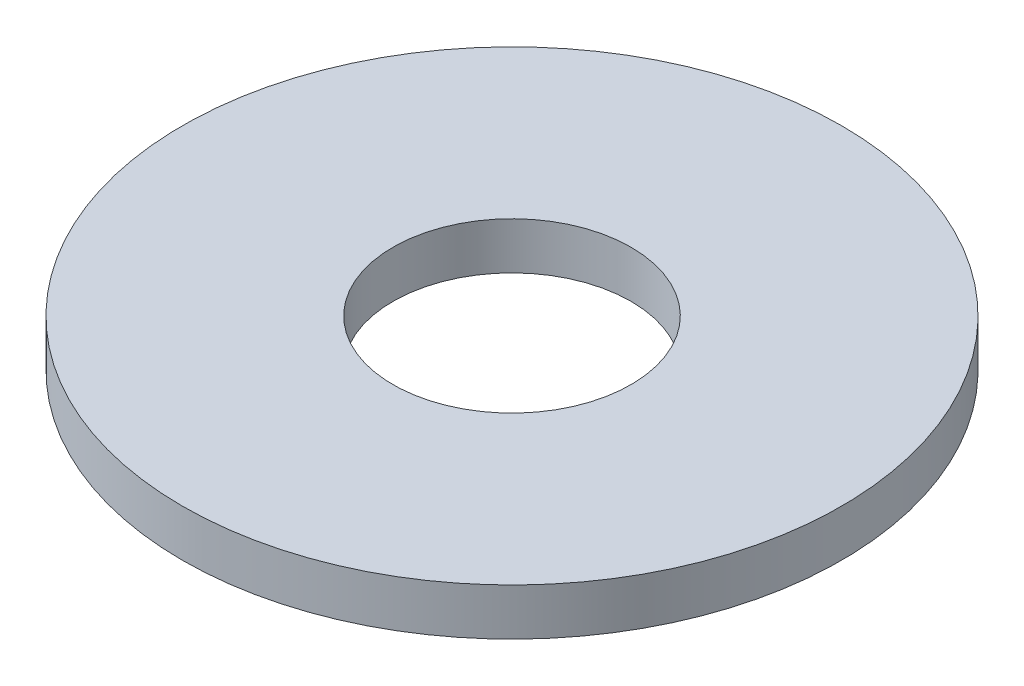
from build123d import *

# Parameters (mm, degrees)
SKETCH1_W = 4.5593
SKETCH1_H = 1.016


with BuildPart() as part:
    # Sketch1 → Base-Revolve (revolve)
    with BuildSketch(Plane.XY, mode=Mode.PRIVATE) as base_revolve_sk:
        with Locations((4.85775, 0.508)):
            Rectangle(SKETCH1_W, SKETCH1_H)
    revolve(base_revolve_sk.sketch.rotate(Axis((0, -50.8, 0), (0, 1, 0)), 90), axis=Axis((0, -50.8, 0), (0, 1, 0)))


solid = part.part
